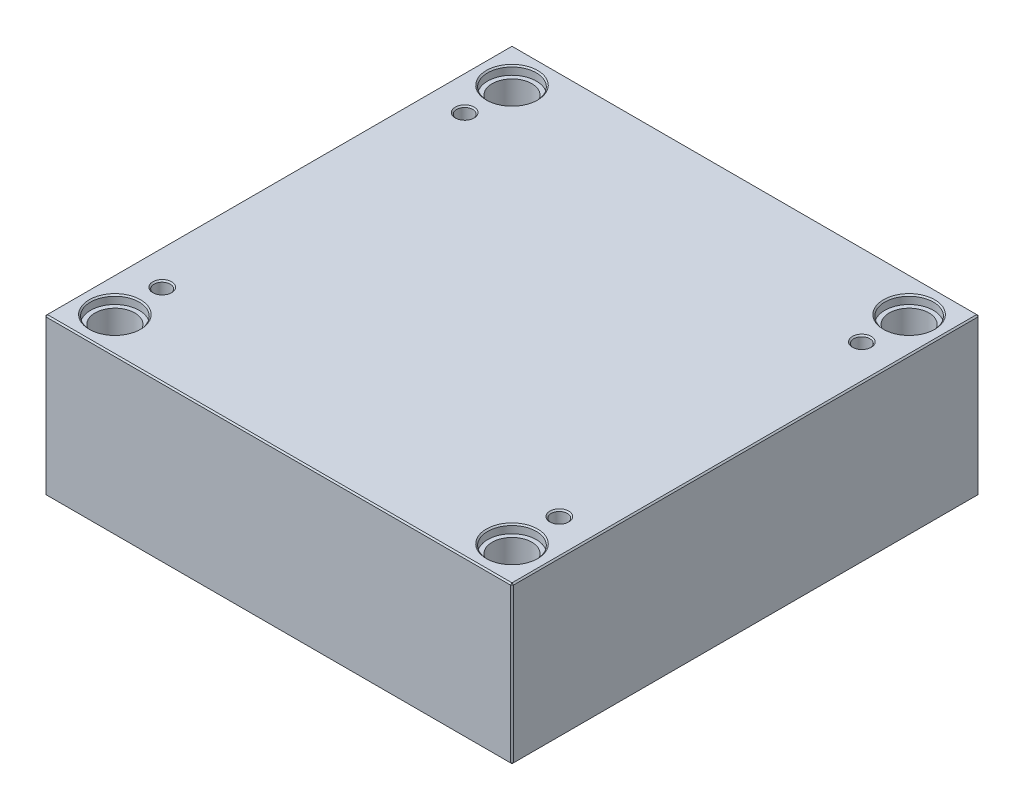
ISO-10303-21;
HEADER;
FILE_DESCRIPTION(('STEP AP214'),'2;1');
FILE_NAME('part.step','',(''),(''),'','','');
FILE_SCHEMA(('AUTOMOTIVE_DESIGN { 1 0 10303 214 1 1 1 1 }'));
ENDSEC;
DATA;
#1=APPLICATION_CONTEXT('core data for automotive mechanical design processes');
#2=APPLICATION_PROTOCOL_DEFINITION('international standard','automotive_design',2000,#1);
#3=PRODUCT_CONTEXT('',#1,'mechanical');
#4=PRODUCT('Part','Part','',(#3));
#5=PRODUCT_RELATED_PRODUCT_CATEGORY('part','',(#4));
#6=PRODUCT_DEFINITION_FORMATION('','',#4);
#7=PRODUCT_DEFINITION_CONTEXT('part definition',#1,'design');
#8=PRODUCT_DEFINITION('design','',#6,#7);
#9=PRODUCT_DEFINITION_SHAPE('','',#8);
#10=(LENGTH_UNIT() NAMED_UNIT(*) SI_UNIT(.MILLI.,.METRE.));
#11=(NAMED_UNIT(*) PLANE_ANGLE_UNIT() SI_UNIT($,.RADIAN.));
#12=(NAMED_UNIT(*) SI_UNIT($,.STERADIAN.) SOLID_ANGLE_UNIT());
#13=UNCERTAINTY_MEASURE_WITH_UNIT(LENGTH_MEASURE(1.E-05),#10,'distance_accuracy_value','');
#14=(GEOMETRIC_REPRESENTATION_CONTEXT(3) GLOBAL_UNCERTAINTY_ASSIGNED_CONTEXT((#13)) GLOBAL_UNIT_ASSIGNED_CONTEXT((#10,
#11,#12)) REPRESENTATION_CONTEXT('',''));
#15=CARTESIAN_POINT('',(0.,0.,0.));
#16=DIRECTION('',(0.,0.,1.));
#17=DIRECTION('',(1.,0.,0.));
#18=AXIS2_PLACEMENT_3D('',#15,#16,#17);
#19=CARTESIAN_POINT('',(-147.,0.,-147.));
#20=DIRECTION('',(0.,1.,0.));
#21=DIRECTION('',(0.,0.,1.));
#22=AXIS2_PLACEMENT_3D('',#19,#20,#21);
#23=CYLINDRICAL_SURFACE('',#22,14.7);
#24=CARTESIAN_POINT('',(-147.,0.999999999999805,-147.));
#25=DIRECTION('',(0.,1.,0.));
#26=DIRECTION('',(0.,0.,1.));
#27=AXIS2_PLACEMENT_3D('',#24,#25,#26);
#28=CIRCLE('',#27,14.7);
#29=CARTESIAN_POINT('',(-147.,0.999999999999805,-132.3));
#30=VERTEX_POINT('',#29);
#31=EDGE_CURVE('E472',#30,#30,#28,.F.);
#32=ORIENTED_EDGE('',*,*,#31,.T.);
#33=EDGE_LOOP('',(#32));
#34=FACE_BOUND('',#33,.T.);
#35=CARTESIAN_POINT('',(-147.,109.7,-147.));
#36=DIRECTION('',(0.,1.,0.));
#37=DIRECTION('',(0.,0.,1.));
#38=AXIS2_PLACEMENT_3D('',#35,#36,#37);
#39=CIRCLE('',#38,14.7);
#40=CARTESIAN_POINT('',(-147.,109.7,-132.3));
#41=VERTEX_POINT('',#40);
#42=EDGE_CURVE('E221',#41,#41,#39,.F.);
#43=ORIENTED_EDGE('',*,*,#42,.F.);
#44=EDGE_LOOP('',(#43));
#45=FACE_BOUND('',#44,.T.);
#46=ADVANCED_FACE('F16',(#34,#45),#23,.F.);
#47=CARTESIAN_POINT('',(147.,0.,-147.));
#48=DIRECTION('',(0.,1.,0.));
#49=DIRECTION('',(0.,0.,1.));
#50=AXIS2_PLACEMENT_3D('',#47,#48,#49);
#51=CYLINDRICAL_SURFACE('',#50,14.7);
#52=CARTESIAN_POINT('',(147.,0.999999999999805,-147.));
#53=DIRECTION('',(0.,1.,0.));
#54=DIRECTION('',(0.,0.,1.));
#55=AXIS2_PLACEMENT_3D('',#52,#53,#54);
#56=CIRCLE('',#55,14.7);
#57=CARTESIAN_POINT('',(147.,0.999999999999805,-132.3));
#58=VERTEX_POINT('',#57);
#59=EDGE_CURVE('E474',#58,#58,#56,.F.);
#60=ORIENTED_EDGE('',*,*,#59,.T.);
#61=EDGE_LOOP('',(#60));
#62=FACE_BOUND('',#61,.T.);
#63=CARTESIAN_POINT('',(147.,109.7,-147.));
#64=DIRECTION('',(0.,1.,0.));
#65=DIRECTION('',(0.,0.,1.));
#66=AXIS2_PLACEMENT_3D('',#63,#64,#65);
#67=CIRCLE('',#66,14.7);
#68=CARTESIAN_POINT('',(147.,109.7,-132.3));
#69=VERTEX_POINT('',#68);
#70=EDGE_CURVE('E218',#69,#69,#67,.F.);
#71=ORIENTED_EDGE('',*,*,#70,.F.);
#72=EDGE_LOOP('',(#71));
#73=FACE_BOUND('',#72,.T.);
#74=ADVANCED_FACE('F263',(#62,#73),#51,.F.);
#75=CARTESIAN_POINT('',(147.,0.,147.));
#76=DIRECTION('',(0.,1.,0.));
#77=DIRECTION('',(0.,0.,1.));
#78=AXIS2_PLACEMENT_3D('',#75,#76,#77);
#79=CYLINDRICAL_SURFACE('',#78,14.7);
#80=CARTESIAN_POINT('',(147.,0.999999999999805,147.));
#81=DIRECTION('',(0.,1.,0.));
#82=DIRECTION('',(0.,0.,1.));
#83=AXIS2_PLACEMENT_3D('',#80,#81,#82);
#84=CIRCLE('',#83,14.7);
#85=CARTESIAN_POINT('',(147.,0.999999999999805,161.7));
#86=VERTEX_POINT('',#85);
#87=EDGE_CURVE('E477',#86,#86,#84,.F.);
#88=ORIENTED_EDGE('',*,*,#87,.T.);
#89=EDGE_LOOP('',(#88));
#90=FACE_BOUND('',#89,.T.);
#91=CARTESIAN_POINT('',(147.,109.7,147.));
#92=DIRECTION('',(0.,1.,0.));
#93=DIRECTION('',(0.,0.,1.));
#94=AXIS2_PLACEMENT_3D('',#91,#92,#93);
#95=CIRCLE('',#94,14.7);
#96=CARTESIAN_POINT('',(147.,109.7,161.7));
#97=VERTEX_POINT('',#96);
#98=EDGE_CURVE('E214',#97,#97,#95,.F.);
#99=ORIENTED_EDGE('',*,*,#98,.F.);
#100=EDGE_LOOP('',(#99));
#101=FACE_BOUND('',#100,.T.);
#102=ADVANCED_FACE('F270',(#90,#101),#79,.F.);
#103=CARTESIAN_POINT('',(-147.,0.,147.));
#104=DIRECTION('',(0.,1.,0.));
#105=DIRECTION('',(0.,0.,1.));
#106=AXIS2_PLACEMENT_3D('',#103,#104,#105);
#107=CYLINDRICAL_SURFACE('',#106,14.7);
#108=CARTESIAN_POINT('',(-147.,0.999999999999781,147.));
#109=DIRECTION('',(0.,1.,0.));
#110=DIRECTION('',(0.,0.,1.));
#111=AXIS2_PLACEMENT_3D('',#108,#109,#110);
#112=CIRCLE('',#111,14.7);
#113=CARTESIAN_POINT('',(-147.,0.999999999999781,161.7));
#114=VERTEX_POINT('',#113);
#115=EDGE_CURVE('E480',#114,#114,#112,.F.);
#116=ORIENTED_EDGE('',*,*,#115,.T.);
#117=EDGE_LOOP('',(#116));
#118=FACE_BOUND('',#117,.T.);
#119=CARTESIAN_POINT('',(-147.,109.7,147.));
#120=DIRECTION('',(0.,1.,0.));
#121=DIRECTION('',(0.,0.,1.));
#122=AXIS2_PLACEMENT_3D('',#119,#120,#121);
#123=CIRCLE('',#122,14.7);
#124=CARTESIAN_POINT('',(-147.,109.7,161.7));
#125=VERTEX_POINT('',#124);
#126=EDGE_CURVE('E211',#125,#125,#123,.F.);
#127=ORIENTED_EDGE('',*,*,#126,.F.);
#128=EDGE_LOOP('',(#127));
#129=FACE_BOUND('',#128,.T.);
#130=ADVANCED_FACE('F277',(#118,#129),#107,.F.);
#131=CARTESIAN_POINT('',(-173.,116.,173.));
#132=DIRECTION('',(1.,0.,0.));
#133=DIRECTION('',(0.,0.,-1.));
#134=AXIS2_PLACEMENT_3D('',#131,#132,#133);
#135=PLANE('',#134);
#136=DIRECTION('',(0.,-1.,0.));
#137=VECTOR('',#136,1.);
#138=CARTESIAN_POINT('',(-173.,116.,-172.));
#139=LINE('',#138,#137);
#140=CARTESIAN_POINT('',(-173.,115.,-172.));
#141=VERTEX_POINT('',#140);
#142=CARTESIAN_POINT('',(-173.,1.00000000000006,-172.));
#143=VERTEX_POINT('',#142);
#144=EDGE_CURVE('E487',#141,#143,#139,.T.);
#145=ORIENTED_EDGE('',*,*,#144,.T.);
#146=DIRECTION('',(0.,0.,1.));
#147=VECTOR('',#146,1.);
#148=CARTESIAN_POINT('',(-173.,1.00000000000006,173.));
#149=LINE('',#148,#147);
#150=CARTESIAN_POINT('',(-173.,1.00000000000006,172.));
#151=VERTEX_POINT('',#150);
#152=EDGE_CURVE('E490',#143,#151,#149,.T.);
#153=ORIENTED_EDGE('',*,*,#152,.T.);
#154=DIRECTION('',(0.,1.,0.));
#155=VECTOR('',#154,1.);
#156=CARTESIAN_POINT('',(-173.,116.,172.));
#157=LINE('',#156,#155);
#158=CARTESIAN_POINT('',(-173.,115.,172.));
#159=VERTEX_POINT('',#158);
#160=EDGE_CURVE('E485',#151,#159,#157,.T.);
#161=ORIENTED_EDGE('',*,*,#160,.T.);
#162=DIRECTION('',(0.,0.,-1.));
#163=VECTOR('',#162,1.);
#164=CARTESIAN_POINT('',(-173.,115.,-173.));
#165=LINE('',#164,#163);
#166=EDGE_CURVE('E483',#159,#141,#165,.T.);
#167=ORIENTED_EDGE('',*,*,#166,.T.);
#168=EDGE_LOOP('',(#145,#153,#161,#167));
#169=FACE_BOUND('',#168,.T.);
#170=ADVANCED_FACE('F298',(#169),#135,.F.);
#171=CARTESIAN_POINT('',(173.,116.,173.));
#172=DIRECTION('',(0.,0.,-1.));
#173=DIRECTION('',(-1.,0.,0.));
#174=AXIS2_PLACEMENT_3D('',#171,#172,#173);
#175=PLANE('',#174);
#176=DIRECTION('',(-1.,0.,0.));
#177=VECTOR('',#176,1.);
#178=CARTESIAN_POINT('',(-173.,115.,173.));
#179=LINE('',#178,#177);
#180=CARTESIAN_POINT('',(172.,115.,173.));
#181=VERTEX_POINT('',#180);
#182=CARTESIAN_POINT('',(-172.,115.,173.));
#183=VERTEX_POINT('',#182);
#184=EDGE_CURVE('E509',#181,#183,#179,.T.);
#185=ORIENTED_EDGE('',*,*,#184,.T.);
#186=DIRECTION('',(0.,-1.,0.));
#187=VECTOR('',#186,1.);
#188=CARTESIAN_POINT('',(-172.,116.,173.));
#189=LINE('',#188,#187);
#190=CARTESIAN_POINT('',(-172.,1.00000000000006,173.));
#191=VERTEX_POINT('',#190);
#192=EDGE_CURVE('E515',#183,#191,#189,.T.);
#193=ORIENTED_EDGE('',*,*,#192,.T.);
#194=DIRECTION('',(1.,0.,0.));
#195=VECTOR('',#194,1.);
#196=CARTESIAN_POINT('',(173.,1.00000000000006,173.));
#197=LINE('',#196,#195);
#198=CARTESIAN_POINT('',(172.,1.00000000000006,173.));
#199=VERTEX_POINT('',#198);
#200=EDGE_CURVE('E513',#191,#199,#197,.T.);
#201=ORIENTED_EDGE('',*,*,#200,.T.);
#202=DIRECTION('',(0.,1.,0.));
#203=VECTOR('',#202,1.);
#204=CARTESIAN_POINT('',(172.,116.,173.));
#205=LINE('',#204,#203);
#206=EDGE_CURVE('E511',#199,#181,#205,.T.);
#207=ORIENTED_EDGE('',*,*,#206,.T.);
#208=EDGE_LOOP('',(#185,#193,#201,#207));
#209=FACE_BOUND('',#208,.T.);
#210=ADVANCED_FACE('F294',(#209),#175,.F.);
#211=CARTESIAN_POINT('',(173.,116.,173.));
#212=DIRECTION('',(-1.,0.,0.));
#213=DIRECTION('',(0.,0.,1.));
#214=AXIS2_PLACEMENT_3D('',#211,#212,#213);
#215=PLANE('',#214);
#216=DIRECTION('',(0.,0.,-1.));
#217=VECTOR('',#216,1.);
#218=CARTESIAN_POINT('',(173.,1.00000000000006,173.));
#219=LINE('',#218,#217);
#220=CARTESIAN_POINT('',(173.,1.00000000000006,172.));
#221=VERTEX_POINT('',#220);
#222=CARTESIAN_POINT('',(173.,1.00000000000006,-172.));
#223=VERTEX_POINT('',#222);
#224=EDGE_CURVE('E504',#221,#223,#219,.T.);
#225=ORIENTED_EDGE('',*,*,#224,.T.);
#226=DIRECTION('',(0.,1.,0.));
#227=VECTOR('',#226,1.);
#228=CARTESIAN_POINT('',(173.,116.,-172.));
#229=LINE('',#228,#227);
#230=CARTESIAN_POINT('',(173.,115.,-172.));
#231=VERTEX_POINT('',#230);
#232=EDGE_CURVE('E506',#223,#231,#229,.T.);
#233=ORIENTED_EDGE('',*,*,#232,.T.);
#234=DIRECTION('',(0.,0.,1.));
#235=VECTOR('',#234,1.);
#236=CARTESIAN_POINT('',(173.,115.,173.));
#237=LINE('',#236,#235);
#238=CARTESIAN_POINT('',(173.,115.,172.));
#239=VERTEX_POINT('',#238);
#240=EDGE_CURVE('E500',#231,#239,#237,.T.);
#241=ORIENTED_EDGE('',*,*,#240,.T.);
#242=DIRECTION('',(0.,-1.,0.));
#243=VECTOR('',#242,1.);
#244=CARTESIAN_POINT('',(173.,116.,172.));
#245=LINE('',#244,#243);
#246=EDGE_CURVE('E502',#239,#221,#245,.T.);
#247=ORIENTED_EDGE('',*,*,#246,.T.);
#248=EDGE_LOOP('',(#225,#233,#241,#247));
#249=FACE_BOUND('',#248,.T.);
#250=ADVANCED_FACE('F290',(#249),#215,.F.);
#251=CARTESIAN_POINT('',(173.,116.,-173.));
#252=DIRECTION('',(0.,0.,1.));
#253=DIRECTION('',(1.,0.,0.));
#254=AXIS2_PLACEMENT_3D('',#251,#252,#253);
#255=PLANE('',#254);
#256=DIRECTION('',(0.,-1.,0.));
#257=VECTOR('',#256,1.);
#258=CARTESIAN_POINT('',(172.,116.,-173.));
#259=LINE('',#258,#257);
#260=CARTESIAN_POINT('',(172.,115.,-173.));
#261=VERTEX_POINT('',#260);
#262=CARTESIAN_POINT('',(172.,1.00000000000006,-173.));
#263=VERTEX_POINT('',#262);
#264=EDGE_CURVE('E494',#261,#263,#259,.T.);
#265=ORIENTED_EDGE('',*,*,#264,.T.);
#266=DIRECTION('',(-1.,0.,0.));
#267=VECTOR('',#266,1.);
#268=CARTESIAN_POINT('',(173.,1.00000000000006,-173.));
#269=LINE('',#268,#267);
#270=CARTESIAN_POINT('',(-172.,1.00000000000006,-173.));
#271=VERTEX_POINT('',#270);
#272=EDGE_CURVE('E138',#263,#271,#269,.T.);
#273=ORIENTED_EDGE('',*,*,#272,.T.);
#274=DIRECTION('',(0.,1.,0.));
#275=VECTOR('',#274,1.);
#276=CARTESIAN_POINT('',(-172.,116.,-173.));
#277=LINE('',#276,#275);
#278=CARTESIAN_POINT('',(-172.,115.,-173.));
#279=VERTEX_POINT('',#278);
#280=EDGE_CURVE('E496',#271,#279,#277,.T.);
#281=ORIENTED_EDGE('',*,*,#280,.T.);
#282=DIRECTION('',(1.,0.,0.));
#283=VECTOR('',#282,1.);
#284=CARTESIAN_POINT('',(173.,115.,-173.));
#285=LINE('',#284,#283);
#286=EDGE_CURVE('E492',#279,#261,#285,.T.);
#287=ORIENTED_EDGE('',*,*,#286,.T.);
#288=EDGE_LOOP('',(#265,#273,#281,#287));
#289=FACE_BOUND('',#288,.T.);
#290=ADVANCED_FACE('F282',(#289),#255,.F.);
#291=CARTESIAN_POINT('',(0.,116.,0.));
#292=DIRECTION('',(0.,1.,0.));
#293=DIRECTION('',(0.,0.,1.));
#294=AXIS2_PLACEMENT_3D('',#291,#292,#293);
#295=PLANE('',#294);
#296=CARTESIAN_POINT('',(147.,116.,147.));
#297=DIRECTION('',(0.,1.,0.));
#298=DIRECTION('',(0.,0.,1.));
#299=AXIS2_PLACEMENT_3D('',#296,#297,#298);
#300=CIRCLE('',#299,19.);
#301=CARTESIAN_POINT('',(147.,116.,166.));
#302=VERTEX_POINT('',#301);
#303=EDGE_CURVE('E236',#302,#302,#300,.F.);
#304=ORIENTED_EDGE('',*,*,#303,.T.);
#305=EDGE_LOOP('',(#304));
#306=FACE_BOUND('',#305,.T.);
#307=CARTESIAN_POINT('',(-147.,116.,147.));
#308=DIRECTION('',(0.,1.,0.));
#309=DIRECTION('',(0.,0.,1.));
#310=AXIS2_PLACEMENT_3D('',#307,#308,#309);
#311=CIRCLE('',#310,19.);
#312=CARTESIAN_POINT('',(-147.,116.,166.));
#313=VERTEX_POINT('',#312);
#314=EDGE_CURVE('E233',#313,#313,#311,.F.);
#315=ORIENTED_EDGE('',*,*,#314,.T.);
#316=EDGE_LOOP('',(#315));
#317=FACE_BOUND('',#316,.T.);
#318=CARTESIAN_POINT('',(147.,116.,-147.));
#319=DIRECTION('',(0.,1.,0.));
#320=DIRECTION('',(0.,0.,1.));
#321=AXIS2_PLACEMENT_3D('',#318,#319,#320);
#322=CIRCLE('',#321,19.);
#323=CARTESIAN_POINT('',(147.,116.,-128.));
#324=VERTEX_POINT('',#323);
#325=EDGE_CURVE('E230',#324,#324,#322,.F.);
#326=ORIENTED_EDGE('',*,*,#325,.T.);
#327=EDGE_LOOP('',(#326));
#328=FACE_BOUND('',#327,.T.);
#329=CARTESIAN_POINT('',(-147.,116.,-147.));
#330=DIRECTION('',(0.,1.,0.));
#331=DIRECTION('',(0.,0.,1.));
#332=AXIS2_PLACEMENT_3D('',#329,#330,#331);
#333=CIRCLE('',#332,19.);
#334=CARTESIAN_POINT('',(-147.,116.,-128.));
#335=VERTEX_POINT('',#334);
#336=EDGE_CURVE('E227',#335,#335,#333,.F.);
#337=ORIENTED_EDGE('',*,*,#336,.T.);
#338=EDGE_LOOP('',(#337));
#339=FACE_BOUND('',#338,.T.);
#340=CARTESIAN_POINT('',(-147.,116.,112.));
#341=DIRECTION('',(0.,1.,0.));
#342=DIRECTION('',(0.,0.,1.));
#343=AXIS2_PLACEMENT_3D('',#340,#341,#342);
#344=CIRCLE('',#343,6.9999999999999);
#345=CARTESIAN_POINT('',(-147.,116.,119.));
#346=VERTEX_POINT('',#345);
#347=EDGE_CURVE('E198',#346,#346,#344,.F.);
#348=ORIENTED_EDGE('',*,*,#347,.T.);
#349=EDGE_LOOP('',(#348));
#350=FACE_BOUND('',#349,.T.);
#351=CARTESIAN_POINT('',(147.,116.,112.));
#352=DIRECTION('',(0.,1.,0.));
#353=DIRECTION('',(0.,0.,1.));
#354=AXIS2_PLACEMENT_3D('',#351,#352,#353);
#355=CIRCLE('',#354,6.9999999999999);
#356=CARTESIAN_POINT('',(147.,116.,119.));
#357=VERTEX_POINT('',#356);
#358=EDGE_CURVE('E195',#357,#357,#355,.F.);
#359=ORIENTED_EDGE('',*,*,#358,.T.);
#360=EDGE_LOOP('',(#359));
#361=FACE_BOUND('',#360,.T.);
#362=CARTESIAN_POINT('',(147.,116.,-112.));
#363=DIRECTION('',(0.,1.,0.));
#364=DIRECTION('',(0.,0.,1.));
#365=AXIS2_PLACEMENT_3D('',#362,#363,#364);
#366=CIRCLE('',#365,6.9999999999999);
#367=CARTESIAN_POINT('',(147.,116.,-105.));
#368=VERTEX_POINT('',#367);
#369=EDGE_CURVE('E192',#368,#368,#366,.F.);
#370=ORIENTED_EDGE('',*,*,#369,.T.);
#371=EDGE_LOOP('',(#370));
#372=FACE_BOUND('',#371,.T.);
#373=CARTESIAN_POINT('',(-147.,116.,-112.));
#374=DIRECTION('',(0.,1.,0.));
#375=DIRECTION('',(0.,0.,1.));
#376=AXIS2_PLACEMENT_3D('',#373,#374,#375);
#377=CIRCLE('',#376,6.9999999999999);
#378=CARTESIAN_POINT('',(-147.,116.,-105.));
#379=VERTEX_POINT('',#378);
#380=EDGE_CURVE('E188',#379,#379,#377,.F.);
#381=ORIENTED_EDGE('',*,*,#380,.T.);
#382=EDGE_LOOP('',(#381));
#383=FACE_BOUND('',#382,.T.);
#384=DIRECTION('',(0.,0.,-1.));
#385=VECTOR('',#384,1.);
#386=CARTESIAN_POINT('',(172.,116.,-173.));
#387=LINE('',#386,#385);
#388=CARTESIAN_POINT('',(172.,116.,172.));
#389=VERTEX_POINT('',#388);
#390=CARTESIAN_POINT('',(172.,116.,-172.));
#391=VERTEX_POINT('',#390);
#392=EDGE_CURVE('E31',#389,#391,#387,.T.);
#393=ORIENTED_EDGE('',*,*,#392,.T.);
#394=DIRECTION('',(-1.,0.,0.));
#395=VECTOR('',#394,1.);
#396=CARTESIAN_POINT('',(-173.,116.,-172.));
#397=LINE('',#396,#395);
#398=CARTESIAN_POINT('',(-172.,116.,-172.));
#399=VERTEX_POINT('',#398);
#400=EDGE_CURVE('E189',#391,#399,#397,.T.);
#401=ORIENTED_EDGE('',*,*,#400,.T.);
#402=DIRECTION('',(0.,0.,1.));
#403=VECTOR('',#402,1.);
#404=CARTESIAN_POINT('',(-172.,116.,173.));
#405=LINE('',#404,#403);
#406=CARTESIAN_POINT('',(-172.,116.,172.));
#407=VERTEX_POINT('',#406);
#408=EDGE_CURVE('E518',#399,#407,#405,.T.);
#409=ORIENTED_EDGE('',*,*,#408,.T.);
#410=DIRECTION('',(1.,0.,0.));
#411=VECTOR('',#410,1.);
#412=CARTESIAN_POINT('',(173.,116.,172.));
#413=LINE('',#412,#411);
#414=EDGE_CURVE('E36',#407,#389,#413,.T.);
#415=ORIENTED_EDGE('',*,*,#414,.T.);
#416=EDGE_LOOP('',(#393,#401,#409,#415));
#417=FACE_BOUND('',#416,.T.);
#418=ADVANCED_FACE('F279',(#306,#317,#328,#339,#350,#361,#372,#383,#417),#295,.T.);
#419=CARTESIAN_POINT('',(0.,0.,0.));
#420=DIRECTION('',(0.,1.,0.));
#421=DIRECTION('',(0.,0.,1.));
#422=AXIS2_PLACEMENT_3D('',#419,#420,#421);
#423=PLANE('',#422);
#424=CARTESIAN_POINT('',(-147.,0.,-147.));
#425=DIRECTION('',(0.,1.,0.));
#426=DIRECTION('',(0.,0.,1.));
#427=AXIS2_PLACEMENT_3D('',#424,#425,#426);
#428=CIRCLE('',#427,15.6999999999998);
#429=CARTESIAN_POINT('',(-147.,0.,-131.3));
#430=VERTEX_POINT('',#429);
#431=EDGE_CURVE('E469',#430,#430,#428,.T.);
#432=ORIENTED_EDGE('',*,*,#431,.T.);
#433=EDGE_LOOP('',(#432));
#434=FACE_BOUND('',#433,.T.);
#435=CARTESIAN_POINT('',(147.,0.,-147.));
#436=DIRECTION('',(0.,1.,0.));
#437=DIRECTION('',(0.,0.,1.));
#438=AXIS2_PLACEMENT_3D('',#435,#436,#437);
#439=CIRCLE('',#438,15.6999999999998);
#440=CARTESIAN_POINT('',(147.,0.,-131.3));
#441=VERTEX_POINT('',#440);
#442=EDGE_CURVE('E466',#441,#441,#439,.T.);
#443=ORIENTED_EDGE('',*,*,#442,.T.);
#444=EDGE_LOOP('',(#443));
#445=FACE_BOUND('',#444,.T.);
#446=CARTESIAN_POINT('',(147.,0.,147.));
#447=DIRECTION('',(0.,1.,0.));
#448=DIRECTION('',(0.,0.,1.));
#449=AXIS2_PLACEMENT_3D('',#446,#447,#448);
#450=CIRCLE('',#449,15.6999999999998);
#451=CARTESIAN_POINT('',(147.,0.,162.7));
#452=VERTEX_POINT('',#451);
#453=EDGE_CURVE('E463',#452,#452,#450,.T.);
#454=ORIENTED_EDGE('',*,*,#453,.T.);
#455=EDGE_LOOP('',(#454));
#456=FACE_BOUND('',#455,.T.);
#457=CARTESIAN_POINT('',(-147.,0.,147.));
#458=DIRECTION('',(0.,1.,0.));
#459=DIRECTION('',(0.,0.,1.));
#460=AXIS2_PLACEMENT_3D('',#457,#458,#459);
#461=CIRCLE('',#460,15.6999999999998);
#462=CARTESIAN_POINT('',(-147.,0.,162.7));
#463=VERTEX_POINT('',#462);
#464=EDGE_CURVE('E460',#463,#463,#461,.T.);
#465=ORIENTED_EDGE('',*,*,#464,.T.);
#466=EDGE_LOOP('',(#465));
#467=FACE_BOUND('',#466,.T.);
#468=DIRECTION('',(0.,0.,1.));
#469=VECTOR('',#468,1.);
#470=CARTESIAN_POINT('',(172.,0.,0.));
#471=LINE('',#470,#469);
#472=CARTESIAN_POINT('',(172.,0.,-172.));
#473=VERTEX_POINT('',#472);
#474=CARTESIAN_POINT('',(172.,0.,172.));
#475=VERTEX_POINT('',#474);
#476=EDGE_CURVE('E108',#473,#475,#471,.T.);
#477=ORIENTED_EDGE('',*,*,#476,.T.);
#478=DIRECTION('',(-1.,0.,0.));
#479=VECTOR('',#478,1.);
#480=CARTESIAN_POINT('',(0.,0.,172.));
#481=LINE('',#480,#479);
#482=CARTESIAN_POINT('',(-172.,0.,172.));
#483=VERTEX_POINT('',#482);
#484=EDGE_CURVE('E458',#475,#483,#481,.T.);
#485=ORIENTED_EDGE('',*,*,#484,.T.);
#486=DIRECTION('',(0.,0.,-1.));
#487=VECTOR('',#486,1.);
#488=CARTESIAN_POINT('',(-172.,0.,0.));
#489=LINE('',#488,#487);
#490=CARTESIAN_POINT('',(-172.,0.,-172.));
#491=VERTEX_POINT('',#490);
#492=EDGE_CURVE('E110',#483,#491,#489,.T.);
#493=ORIENTED_EDGE('',*,*,#492,.T.);
#494=DIRECTION('',(1.,0.,0.));
#495=VECTOR('',#494,1.);
#496=CARTESIAN_POINT('',(0.,0.,-172.));
#497=LINE('',#496,#495);
#498=EDGE_CURVE('E104',#491,#473,#497,.T.);
#499=ORIENTED_EDGE('',*,*,#498,.T.);
#500=EDGE_LOOP('',(#477,#485,#493,#499));
#501=FACE_BOUND('',#500,.T.);
#502=ADVANCED_FACE('F106',(#434,#445,#456,#467,#501),#423,.F.);
#503=CARTESIAN_POINT('',(-147.,0.,-147.));
#504=DIRECTION('',(0.,-1.,0.));
#505=DIRECTION('',(0.,0.,-1.));
#506=AXIS2_PLACEMENT_3D('',#503,#504,#505);
#507=CONICAL_SURFACE('',#506,15.6999999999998,0.785398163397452);
#508=ORIENTED_EDGE('',*,*,#31,.F.);
#509=EDGE_LOOP('',(#508));
#510=FACE_BOUND('',#509,.T.);
#511=ORIENTED_EDGE('',*,*,#431,.F.);
#512=EDGE_LOOP('',(#511));
#513=FACE_BOUND('',#512,.T.);
#514=ADVANCED_FACE('F286',(#510,#513),#507,.F.);
#515=CARTESIAN_POINT('',(147.,0.,-147.));
#516=DIRECTION('',(0.,-1.,0.));
#517=DIRECTION('',(0.,0.,-1.));
#518=AXIS2_PLACEMENT_3D('',#515,#516,#517);
#519=CONICAL_SURFACE('',#518,15.6999999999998,0.785398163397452);
#520=ORIENTED_EDGE('',*,*,#59,.F.);
#521=EDGE_LOOP('',(#520));
#522=FACE_BOUND('',#521,.T.);
#523=ORIENTED_EDGE('',*,*,#442,.F.);
#524=EDGE_LOOP('',(#523));
#525=FACE_BOUND('',#524,.T.);
#526=ADVANCED_FACE('F305',(#522,#525),#519,.F.);
#527=CARTESIAN_POINT('',(147.,0.,147.));
#528=DIRECTION('',(0.,-1.,0.));
#529=DIRECTION('',(0.,0.,-1.));
#530=AXIS2_PLACEMENT_3D('',#527,#528,#529);
#531=CONICAL_SURFACE('',#530,15.6999999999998,0.785398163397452);
#532=ORIENTED_EDGE('',*,*,#87,.F.);
#533=EDGE_LOOP('',(#532));
#534=FACE_BOUND('',#533,.T.);
#535=ORIENTED_EDGE('',*,*,#453,.F.);
#536=EDGE_LOOP('',(#535));
#537=FACE_BOUND('',#536,.T.);
#538=ADVANCED_FACE('F309',(#534,#537),#531,.F.);
#539=CARTESIAN_POINT('',(-147.,0.,147.));
#540=DIRECTION('',(0.,-1.,0.));
#541=DIRECTION('',(0.,0.,-1.));
#542=AXIS2_PLACEMENT_3D('',#539,#540,#541);
#543=CONICAL_SURFACE('',#542,15.6999999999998,0.78539816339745);
#544=ORIENTED_EDGE('',*,*,#115,.F.);
#545=EDGE_LOOP('',(#544));
#546=FACE_BOUND('',#545,.T.);
#547=ORIENTED_EDGE('',*,*,#464,.F.);
#548=EDGE_LOOP('',(#547));
#549=FACE_BOUND('',#548,.T.);
#550=ADVANCED_FACE('F313',(#546,#549),#543,.F.);
#551=CARTESIAN_POINT('',(173.,116.,172.));
#552=DIRECTION('',(-0.707106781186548,0.,-0.707106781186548));
#553=DIRECTION('',(0.,-1.,0.));
#554=AXIS2_PLACEMENT_3D('',#551,#552,#553);
#555=PLANE('',#554);
#556=DIRECTION('',(-0.707106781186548,0.,0.707106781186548));
#557=VECTOR('',#556,1.);
#558=CARTESIAN_POINT('',(172.,115.,173.));
#559=LINE('',#558,#557);
#560=EDGE_CURVE('E126',#181,#239,#559,.F.);
#561=ORIENTED_EDGE('',*,*,#560,.F.);
#562=ORIENTED_EDGE('',*,*,#206,.F.);
#563=DIRECTION('',(0.707106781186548,0.,-0.707106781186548));
#564=VECTOR('',#563,1.);
#565=CARTESIAN_POINT('',(172.,1.00000000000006,173.));
#566=LINE('',#565,#564);
#567=EDGE_CURVE('E180',#221,#199,#566,.F.);
#568=ORIENTED_EDGE('',*,*,#567,.F.);
#569=ORIENTED_EDGE('',*,*,#246,.F.);
#570=EDGE_LOOP('',(#561,#562,#568,#569));
#571=FACE_BOUND('',#570,.T.);
#572=ADVANCED_FACE('F317',(#571),#555,.F.);
#573=CARTESIAN_POINT('',(172.,115.,173.));
#574=DIRECTION('',(0.577350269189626,0.577350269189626,0.577350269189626));
#575=DIRECTION('',(0.707106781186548,0.,-0.707106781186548));
#576=AXIS2_PLACEMENT_3D('',#573,#574,#575);
#577=PLANE('',#576);
#578=DIRECTION('',(0.,-0.707106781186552,0.707106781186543));
#579=VECTOR('',#578,1.);
#580=CARTESIAN_POINT('',(172.,115.,173.));
#581=LINE('',#580,#579);
#582=EDGE_CURVE('E175',#181,#389,#581,.F.);
#583=ORIENTED_EDGE('',*,*,#582,.F.);
#584=ORIENTED_EDGE('',*,*,#560,.T.);
#585=DIRECTION('',(-0.707106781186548,0.707106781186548,0.));
#586=VECTOR('',#585,1.);
#587=CARTESIAN_POINT('',(172.5,115.5,172.));
#588=LINE('',#587,#586);
#589=EDGE_CURVE('E177',#389,#239,#588,.F.);
#590=ORIENTED_EDGE('',*,*,#589,.F.);
#591=EDGE_LOOP('',(#583,#584,#590));
#592=FACE_BOUND('',#591,.T.);
#593=ADVANCED_FACE('F385',(#592),#577,.T.);
#594=CARTESIAN_POINT('',(172.,1.00000000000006,173.));
#595=DIRECTION('',(0.577350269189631,-0.577350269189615,0.577350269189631));
#596=DIRECTION('',(0.707106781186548,0.,-0.707106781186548));
#597=AXIS2_PLACEMENT_3D('',#594,#595,#596);
#598=PLANE('',#597);
#599=DIRECTION('',(-0.707106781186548,-0.707106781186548,0.));
#600=VECTOR('',#599,1.);
#601=CARTESIAN_POINT('',(172.5,0.500000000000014,172.));
#602=LINE('',#601,#600);
#603=EDGE_CURVE('E124',#221,#475,#602,.T.);
#604=ORIENTED_EDGE('',*,*,#603,.F.);
#605=ORIENTED_EDGE('',*,*,#567,.T.);
#606=DIRECTION('',(0.,0.707106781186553,0.707106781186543));
#607=VECTOR('',#606,1.);
#608=CARTESIAN_POINT('',(172.,1.00000000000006,173.));
#609=LINE('',#608,#607);
#610=EDGE_CURVE('E172',#475,#199,#609,.T.);
#611=ORIENTED_EDGE('',*,*,#610,.F.);
#612=EDGE_LOOP('',(#604,#605,#611));
#613=FACE_BOUND('',#612,.T.);
#614=ADVANCED_FACE('F381',(#613),#598,.T.);
#615=CARTESIAN_POINT('',(172.,116.,0.));
#616=DIRECTION('',(0.707106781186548,0.707106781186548,0.));
#617=DIRECTION('',(0.,0.,1.));
#618=AXIS2_PLACEMENT_3D('',#615,#616,#617);
#619=PLANE('',#618);
#620=ORIENTED_EDGE('',*,*,#589,.T.);
#621=ORIENTED_EDGE('',*,*,#240,.F.);
#622=DIRECTION('',(0.707106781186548,-0.707106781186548,0.));
#623=VECTOR('',#622,1.);
#624=CARTESIAN_POINT('',(173.,115.,-172.));
#625=LINE('',#624,#623);
#626=EDGE_CURVE('E166',#391,#231,#625,.T.);
#627=ORIENTED_EDGE('',*,*,#626,.F.);
#628=ORIENTED_EDGE('',*,*,#392,.F.);
#629=EDGE_LOOP('',(#620,#621,#627,#628));
#630=FACE_BOUND('',#629,.T.);
#631=ADVANCED_FACE('F377',(#630),#619,.T.);
#632=CARTESIAN_POINT('',(0.,116.,172.));
#633=DIRECTION('',(0.,0.707106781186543,0.707106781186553));
#634=DIRECTION('',(-1.,0.,0.));
#635=AXIS2_PLACEMENT_3D('',#632,#633,#634);
#636=PLANE('',#635);
#637=ORIENTED_EDGE('',*,*,#582,.T.);
#638=ORIENTED_EDGE('',*,*,#414,.F.);
#639=DIRECTION('',(0.,0.707106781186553,-0.707106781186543));
#640=VECTOR('',#639,1.);
#641=CARTESIAN_POINT('',(-172.,115.5,172.5));
#642=LINE('',#641,#640);
#643=EDGE_CURVE('E163',#183,#407,#642,.T.);
#644=ORIENTED_EDGE('',*,*,#643,.F.);
#645=ORIENTED_EDGE('',*,*,#184,.F.);
#646=EDGE_LOOP('',(#637,#638,#644,#645));
#647=FACE_BOUND('',#646,.T.);
#648=ADVANCED_FACE('F373',(#647),#636,.T.);
#649=CARTESIAN_POINT('',(-172.,116.,173.));
#650=DIRECTION('',(0.707106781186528,0.,-0.707106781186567));
#651=DIRECTION('',(0.,-1.,0.));
#652=AXIS2_PLACEMENT_3D('',#649,#650,#651);
#653=PLANE('',#652);
#654=DIRECTION('',(0.707106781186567,0.,0.707106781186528));
#655=VECTOR('',#654,1.);
#656=CARTESIAN_POINT('',(-172.,1.00000000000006,173.));
#657=LINE('',#656,#655);
#658=EDGE_CURVE('E157',#191,#151,#657,.F.);
#659=ORIENTED_EDGE('',*,*,#658,.F.);
#660=ORIENTED_EDGE('',*,*,#192,.F.);
#661=DIRECTION('',(-0.707106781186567,0.,-0.707106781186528));
#662=VECTOR('',#661,1.);
#663=CARTESIAN_POINT('',(-173.,115.,172.));
#664=LINE('',#663,#662);
#665=EDGE_CURVE('E160',#159,#183,#664,.F.);
#666=ORIENTED_EDGE('',*,*,#665,.F.);
#667=ORIENTED_EDGE('',*,*,#160,.F.);
#668=EDGE_LOOP('',(#659,#660,#666,#667));
#669=FACE_BOUND('',#668,.T.);
#670=ADVANCED_FACE('F369',(#669),#653,.F.);
#671=CARTESIAN_POINT('',(173.,1.00000000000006,173.));
#672=DIRECTION('',(0.,0.707106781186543,-0.707106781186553));
#673=DIRECTION('',(1.,0.,0.));
#674=AXIS2_PLACEMENT_3D('',#671,#672,#673);
#675=PLANE('',#674);
#676=ORIENTED_EDGE('',*,*,#610,.T.);
#677=ORIENTED_EDGE('',*,*,#200,.F.);
#678=DIRECTION('',(0.,-0.707106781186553,-0.707106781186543));
#679=VECTOR('',#678,1.);
#680=CARTESIAN_POINT('',(-172.,1.00000000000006,173.));
#681=LINE('',#680,#679);
#682=EDGE_CURVE('E135',#483,#191,#681,.F.);
#683=ORIENTED_EDGE('',*,*,#682,.F.);
#684=ORIENTED_EDGE('',*,*,#484,.F.);
#685=EDGE_LOOP('',(#676,#677,#683,#684));
#686=FACE_BOUND('',#685,.T.);
#687=ADVANCED_FACE('F366',(#686),#675,.F.);
#688=CARTESIAN_POINT('',(173.,1.00000000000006,173.));
#689=DIRECTION('',(-0.707106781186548,0.707106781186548,0.));
#690=DIRECTION('',(0.,0.,-1.));
#691=AXIS2_PLACEMENT_3D('',#688,#689,#690);
#692=PLANE('',#691);
#693=ORIENTED_EDGE('',*,*,#603,.T.);
#694=ORIENTED_EDGE('',*,*,#476,.F.);
#695=DIRECTION('',(0.707106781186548,0.707106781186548,0.));
#696=VECTOR('',#695,1.);
#697=CARTESIAN_POINT('',(172.5,0.499999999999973,-172.));
#698=LINE('',#697,#696);
#699=EDGE_CURVE('E121',#223,#473,#698,.F.);
#700=ORIENTED_EDGE('',*,*,#699,.F.);
#701=ORIENTED_EDGE('',*,*,#224,.F.);
#702=EDGE_LOOP('',(#693,#694,#700,#701));
#703=FACE_BOUND('',#702,.T.);
#704=ADVANCED_FACE('F119',(#703),#692,.F.);
#705=CARTESIAN_POINT('',(172.,116.,-173.));
#706=DIRECTION('',(-0.707106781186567,0.,0.707106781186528));
#707=DIRECTION('',(0.,-1.,0.));
#708=AXIS2_PLACEMENT_3D('',#705,#706,#707);
#709=PLANE('',#708);
#710=DIRECTION('',(0.707106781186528,0.,0.707106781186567));
#711=VECTOR('',#710,1.);
#712=CARTESIAN_POINT('',(173.,115.,-172.));
#713=LINE('',#712,#711);
#714=EDGE_CURVE('E168',#231,#261,#713,.F.);
#715=ORIENTED_EDGE('',*,*,#714,.F.);
#716=ORIENTED_EDGE('',*,*,#232,.F.);
#717=DIRECTION('',(-0.707106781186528,0.,-0.707106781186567));
#718=VECTOR('',#717,1.);
#719=CARTESIAN_POINT('',(172.,1.00000000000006,-173.));
#720=LINE('',#719,#718);
#721=EDGE_CURVE('E134',#263,#223,#720,.F.);
#722=ORIENTED_EDGE('',*,*,#721,.F.);
#723=ORIENTED_EDGE('',*,*,#264,.F.);
#724=EDGE_LOOP('',(#715,#716,#722,#723));
#725=FACE_BOUND('',#724,.T.);
#726=ADVANCED_FACE('F359',(#725),#709,.F.);
#727=CARTESIAN_POINT('',(173.,115.,-172.));
#728=DIRECTION('',(0.577350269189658,0.577350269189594,-0.577350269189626));
#729=DIRECTION('',(-0.707106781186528,0.,-0.707106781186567));
#730=AXIS2_PLACEMENT_3D('',#727,#728,#729);
#731=PLANE('',#730);
#732=ORIENTED_EDGE('',*,*,#626,.T.);
#733=ORIENTED_EDGE('',*,*,#714,.T.);
#734=DIRECTION('',(0.,0.707106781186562,0.707106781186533));
#735=VECTOR('',#734,1.);
#736=CARTESIAN_POINT('',(172.,115.5,-172.5));
#737=LINE('',#736,#735);
#738=EDGE_CURVE('E152',#391,#261,#737,.F.);
#739=ORIENTED_EDGE('',*,*,#738,.F.);
#740=EDGE_LOOP('',(#732,#733,#739));
#741=FACE_BOUND('',#740,.T.);
#742=ADVANCED_FACE('F355',(#741),#731,.T.);
#743=CARTESIAN_POINT('',(-173.,115.,172.));
#744=DIRECTION('',(-0.577350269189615,0.577350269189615,0.577350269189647));
#745=DIRECTION('',(0.707106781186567,0.,0.707106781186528));
#746=AXIS2_PLACEMENT_3D('',#743,#744,#745);
#747=PLANE('',#746);
#748=ORIENTED_EDGE('',*,*,#665,.T.);
#749=ORIENTED_EDGE('',*,*,#643,.T.);
#750=DIRECTION('',(-0.707106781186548,-0.707106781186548,0.));
#751=VECTOR('',#750,1.);
#752=CARTESIAN_POINT('',(-173.,115.,172.));
#753=LINE('',#752,#751);
#754=EDGE_CURVE('E143',#159,#407,#753,.F.);
#755=ORIENTED_EDGE('',*,*,#754,.F.);
#756=EDGE_LOOP('',(#748,#749,#755));
#757=FACE_BOUND('',#756,.T.);
#758=ADVANCED_FACE('F351',(#757),#747,.T.);
#759=CARTESIAN_POINT('',(-172.,1.00000000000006,173.));
#760=DIRECTION('',(-0.57735026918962,-0.577350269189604,0.577350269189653));
#761=DIRECTION('',(0.707106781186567,0.,0.707106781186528));
#762=AXIS2_PLACEMENT_3D('',#759,#760,#761);
#763=PLANE('',#762);
#764=ORIENTED_EDGE('',*,*,#682,.T.);
#765=ORIENTED_EDGE('',*,*,#658,.T.);
#766=DIRECTION('',(-0.707106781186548,0.707106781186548,0.));
#767=VECTOR('',#766,1.);
#768=CARTESIAN_POINT('',(-172.5,0.499999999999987,172.));
#769=LINE('',#768,#767);
#770=EDGE_CURVE('E139',#483,#151,#769,.T.);
#771=ORIENTED_EDGE('',*,*,#770,.F.);
#772=EDGE_LOOP('',(#764,#765,#771));
#773=FACE_BOUND('',#772,.T.);
#774=ADVANCED_FACE('F348',(#773),#763,.T.);
#775=CARTESIAN_POINT('',(172.,1.00000000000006,-173.));
#776=DIRECTION('',(0.577350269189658,-0.577350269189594,-0.577350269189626));
#777=DIRECTION('',(-0.707106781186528,0.,-0.707106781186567));
#778=AXIS2_PLACEMENT_3D('',#775,#776,#777);
#779=PLANE('',#778);
#780=ORIENTED_EDGE('',*,*,#721,.T.);
#781=ORIENTED_EDGE('',*,*,#699,.T.);
#782=DIRECTION('',(0.,-0.707106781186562,0.707106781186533));
#783=VECTOR('',#782,1.);
#784=CARTESIAN_POINT('',(172.,1.00000000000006,-173.));
#785=LINE('',#784,#783);
#786=EDGE_CURVE('E131',#263,#473,#785,.T.);
#787=ORIENTED_EDGE('',*,*,#786,.F.);
#788=EDGE_LOOP('',(#780,#781,#787));
#789=FACE_BOUND('',#788,.T.);
#790=ADVANCED_FACE('F130',(#789),#779,.T.);
#791=CARTESIAN_POINT('',(0.,116.,-172.));
#792=DIRECTION('',(0.,0.707106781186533,-0.707106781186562));
#793=DIRECTION('',(1.,0.,0.));
#794=AXIS2_PLACEMENT_3D('',#791,#792,#793);
#795=PLANE('',#794);
#796=ORIENTED_EDGE('',*,*,#738,.T.);
#797=ORIENTED_EDGE('',*,*,#286,.F.);
#798=DIRECTION('',(0.,-0.707106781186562,-0.707106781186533));
#799=VECTOR('',#798,1.);
#800=CARTESIAN_POINT('',(-172.,115.,-173.));
#801=LINE('',#800,#799);
#802=EDGE_CURVE('E140',#399,#279,#801,.T.);
#803=ORIENTED_EDGE('',*,*,#802,.F.);
#804=ORIENTED_EDGE('',*,*,#400,.F.);
#805=EDGE_LOOP('',(#796,#797,#803,#804));
#806=FACE_BOUND('',#805,.T.);
#807=ADVANCED_FACE('F341',(#806),#795,.T.);
#808=CARTESIAN_POINT('',(-172.,116.,0.));
#809=DIRECTION('',(-0.707106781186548,0.707106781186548,0.));
#810=DIRECTION('',(0.,0.,-1.));
#811=AXIS2_PLACEMENT_3D('',#808,#809,#810);
#812=PLANE('',#811);
#813=ORIENTED_EDGE('',*,*,#754,.T.);
#814=ORIENTED_EDGE('',*,*,#408,.F.);
#815=DIRECTION('',(0.707106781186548,0.707106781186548,0.));
#816=VECTOR('',#815,1.);
#817=CARTESIAN_POINT('',(-172.5,115.5,-172.));
#818=LINE('',#817,#816);
#819=EDGE_CURVE('E146',#141,#399,#818,.T.);
#820=ORIENTED_EDGE('',*,*,#819,.F.);
#821=ORIENTED_EDGE('',*,*,#166,.F.);
#822=EDGE_LOOP('',(#813,#814,#820,#821));
#823=FACE_BOUND('',#822,.T.);
#824=ADVANCED_FACE('F337',(#823),#812,.T.);
#825=CARTESIAN_POINT('',(-173.,1.00000000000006,173.));
#826=DIRECTION('',(0.707106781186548,0.707106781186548,0.));
#827=DIRECTION('',(0.,0.,1.));
#828=AXIS2_PLACEMENT_3D('',#825,#826,#827);
#829=PLANE('',#828);
#830=ORIENTED_EDGE('',*,*,#770,.T.);
#831=ORIENTED_EDGE('',*,*,#152,.F.);
#832=DIRECTION('',(0.707106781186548,-0.707106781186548,0.));
#833=VECTOR('',#832,1.);
#834=CARTESIAN_POINT('',(-173.,1.00000000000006,-172.));
#835=LINE('',#834,#833);
#836=EDGE_CURVE('E529',#491,#143,#835,.F.);
#837=ORIENTED_EDGE('',*,*,#836,.F.);
#838=ORIENTED_EDGE('',*,*,#492,.F.);
#839=EDGE_LOOP('',(#830,#831,#837,#838));
#840=FACE_BOUND('',#839,.T.);
#841=ADVANCED_FACE('F334',(#840),#829,.F.);
#842=CARTESIAN_POINT('',(173.,1.00000000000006,-173.));
#843=DIRECTION('',(0.,0.707106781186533,0.707106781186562));
#844=DIRECTION('',(-1.,0.,0.));
#845=AXIS2_PLACEMENT_3D('',#842,#843,#844);
#846=PLANE('',#845);
#847=ORIENTED_EDGE('',*,*,#786,.T.);
#848=ORIENTED_EDGE('',*,*,#498,.F.);
#849=DIRECTION('',(0.,0.707106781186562,-0.707106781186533));
#850=VECTOR('',#849,1.);
#851=CARTESIAN_POINT('',(-172.,0.499999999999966,-172.5));
#852=LINE('',#851,#850);
#853=EDGE_CURVE('E526',#271,#491,#852,.F.);
#854=ORIENTED_EDGE('',*,*,#853,.F.);
#855=ORIENTED_EDGE('',*,*,#272,.F.);
#856=EDGE_LOOP('',(#847,#848,#854,#855));
#857=FACE_BOUND('',#856,.T.);
#858=ADVANCED_FACE('F137',(#857),#846,.F.);
#859=CARTESIAN_POINT('',(-172.,115.,-173.));
#860=DIRECTION('',(-0.577350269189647,0.577350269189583,-0.577350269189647));
#861=DIRECTION('',(-0.707106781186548,0.,0.707106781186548));
#862=AXIS2_PLACEMENT_3D('',#859,#860,#861);
#863=PLANE('',#862);
#864=ORIENTED_EDGE('',*,*,#819,.T.);
#865=ORIENTED_EDGE('',*,*,#802,.T.);
#866=DIRECTION('',(0.707106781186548,0.,-0.707106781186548));
#867=VECTOR('',#866,1.);
#868=CARTESIAN_POINT('',(-172.,115.,-173.));
#869=LINE('',#868,#867);
#870=EDGE_CURVE('E524',#141,#279,#869,.T.);
#871=ORIENTED_EDGE('',*,*,#870,.F.);
#872=EDGE_LOOP('',(#864,#865,#871));
#873=FACE_BOUND('',#872,.T.);
#874=ADVANCED_FACE('F327',(#873),#863,.T.);
#875=CARTESIAN_POINT('',(-173.,1.00000000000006,-172.));
#876=DIRECTION('',(-0.577350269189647,-0.577350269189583,-0.577350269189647));
#877=DIRECTION('',(-0.707106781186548,0.,0.707106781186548));
#878=AXIS2_PLACEMENT_3D('',#875,#876,#877);
#879=PLANE('',#878);
#880=ORIENTED_EDGE('',*,*,#853,.T.);
#881=ORIENTED_EDGE('',*,*,#836,.T.);
#882=DIRECTION('',(-0.707106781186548,0.,0.707106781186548));
#883=VECTOR('',#882,1.);
#884=CARTESIAN_POINT('',(-173.,1.00000000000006,-172.));
#885=LINE('',#884,#883);
#886=EDGE_CURVE('E455',#271,#143,#885,.T.);
#887=ORIENTED_EDGE('',*,*,#886,.F.);
#888=EDGE_LOOP('',(#880,#881,#887));
#889=FACE_BOUND('',#888,.T.);
#890=ADVANCED_FACE('F323',(#889),#879,.T.);
#891=CARTESIAN_POINT('',(-173.,116.,-172.));
#892=DIRECTION('',(0.707106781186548,0.,0.707106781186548));
#893=DIRECTION('',(0.,-1.,0.));
#894=AXIS2_PLACEMENT_3D('',#891,#892,#893);
#895=PLANE('',#894);
#896=ORIENTED_EDGE('',*,*,#870,.T.);
#897=ORIENTED_EDGE('',*,*,#280,.F.);
#898=ORIENTED_EDGE('',*,*,#886,.T.);
#899=ORIENTED_EDGE('',*,*,#144,.F.);
#900=EDGE_LOOP('',(#896,#897,#898,#899));
#901=FACE_BOUND('',#900,.T.);
#902=ADVANCED_FACE('F319',(#901),#895,.F.);
#903=CARTESIAN_POINT('',(-147.,92.,-112.));
#904=DIRECTION('',(0.,1.,0.));
#905=DIRECTION('',(0.,0.,1.));
#906=AXIS2_PLACEMENT_3D('',#903,#904,#905);
#907=CYLINDRICAL_SURFACE('',#906,6.);
#908=CARTESIAN_POINT('',(-147.,115.,-112.));
#909=DIRECTION('',(0.,1.,0.));
#910=DIRECTION('',(0.,0.,1.));
#911=AXIS2_PLACEMENT_3D('',#908,#909,#910);
#912=CIRCLE('',#911,6.);
#913=CARTESIAN_POINT('',(-147.,115.,-106.));
#914=VERTEX_POINT('',#913);
#915=EDGE_CURVE('E207',#914,#914,#912,.T.);
#916=ORIENTED_EDGE('',*,*,#915,.T.);
#917=EDGE_LOOP('',(#916));
#918=FACE_BOUND('',#917,.T.);
#919=CARTESIAN_POINT('',(-147.,92.,-112.));
#920=DIRECTION('',(0.,1.,0.));
#921=DIRECTION('',(0.,0.,1.));
#922=AXIS2_PLACEMENT_3D('',#919,#920,#921);
#923=CIRCLE('',#922,6.);
#924=CARTESIAN_POINT('',(-147.,92.,-106.));
#925=VERTEX_POINT('',#924);
#926=EDGE_CURVE('E448',#925,#925,#923,.T.);
#927=ORIENTED_EDGE('',*,*,#926,.F.);
#928=EDGE_LOOP('',(#927));
#929=FACE_BOUND('',#928,.T.);
#930=ADVANCED_FACE('F322',(#918,#929),#907,.F.);
#931=CARTESIAN_POINT('',(-147.,92.,-112.));
#932=DIRECTION('',(0.,1.,0.));
#933=DIRECTION('',(0.,0.,1.));
#934=AXIS2_PLACEMENT_3D('',#931,#932,#933);
#935=PLANE('',#934);
#936=ORIENTED_EDGE('',*,*,#926,.T.);
#937=EDGE_LOOP('',(#936));
#938=FACE_BOUND('',#937,.T.);
#939=ADVANCED_FACE('F596',(#938),#935,.T.);
#940=CARTESIAN_POINT('',(147.,92.,-112.));
#941=DIRECTION('',(0.,1.,0.));
#942=DIRECTION('',(0.,0.,1.));
#943=AXIS2_PLACEMENT_3D('',#940,#941,#942);
#944=CYLINDRICAL_SURFACE('',#943,6.00000000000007);
#945=CARTESIAN_POINT('',(147.,115.,-112.));
#946=DIRECTION('',(0.,1.,0.));
#947=DIRECTION('',(0.,0.,1.));
#948=AXIS2_PLACEMENT_3D('',#945,#946,#947);
#949=CIRCLE('',#948,6.00000000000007);
#950=CARTESIAN_POINT('',(147.,115.,-106.));
#951=VERTEX_POINT('',#950);
#952=EDGE_CURVE('E204',#951,#951,#949,.T.);
#953=ORIENTED_EDGE('',*,*,#952,.T.);
#954=EDGE_LOOP('',(#953));
#955=FACE_BOUND('',#954,.T.);
#956=CARTESIAN_POINT('',(147.,92.,-112.));
#957=DIRECTION('',(0.,1.,0.));
#958=DIRECTION('',(0.,0.,1.));
#959=AXIS2_PLACEMENT_3D('',#956,#957,#958);
#960=CIRCLE('',#959,6.00000000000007);
#961=CARTESIAN_POINT('',(147.,92.,-106.));
#962=VERTEX_POINT('',#961);
#963=EDGE_CURVE('E445',#962,#962,#960,.T.);
#964=ORIENTED_EDGE('',*,*,#963,.F.);
#965=EDGE_LOOP('',(#964));
#966=FACE_BOUND('',#965,.T.);
#967=ADVANCED_FACE('F592',(#955,#966),#944,.F.);
#968=CARTESIAN_POINT('',(147.,92.,-112.));
#969=DIRECTION('',(0.,1.,0.));
#970=DIRECTION('',(0.,0.,1.));
#971=AXIS2_PLACEMENT_3D('',#968,#969,#970);
#972=PLANE('',#971);
#973=ORIENTED_EDGE('',*,*,#963,.T.);
#974=EDGE_LOOP('',(#973));
#975=FACE_BOUND('',#974,.T.);
#976=ADVANCED_FACE('F588',(#975),#972,.T.);
#977=CARTESIAN_POINT('',(147.,92.,112.));
#978=DIRECTION('',(0.,1.,0.));
#979=DIRECTION('',(0.,0.,1.));
#980=AXIS2_PLACEMENT_3D('',#977,#978,#979);
#981=CYLINDRICAL_SURFACE('',#980,6.00000000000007);
#982=CARTESIAN_POINT('',(147.,115.,112.));
#983=DIRECTION('',(0.,1.,0.));
#984=DIRECTION('',(0.,0.,1.));
#985=AXIS2_PLACEMENT_3D('',#982,#983,#984);
#986=CIRCLE('',#985,6.00000000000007);
#987=CARTESIAN_POINT('',(147.,115.,118.));
#988=VERTEX_POINT('',#987);
#989=EDGE_CURVE('E201',#988,#988,#986,.T.);
#990=ORIENTED_EDGE('',*,*,#989,.T.);
#991=EDGE_LOOP('',(#990));
#992=FACE_BOUND('',#991,.T.);
#993=CARTESIAN_POINT('',(147.,92.,112.));
#994=DIRECTION('',(0.,1.,0.));
#995=DIRECTION('',(0.,0.,1.));
#996=AXIS2_PLACEMENT_3D('',#993,#994,#995);
#997=CIRCLE('',#996,6.00000000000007);
#998=CARTESIAN_POINT('',(147.,92.,118.));
#999=VERTEX_POINT('',#998);
#1000=EDGE_CURVE('E449',#999,#999,#997,.T.);
#1001=ORIENTED_EDGE('',*,*,#1000,.F.);
#1002=EDGE_LOOP('',(#1001));
#1003=FACE_BOUND('',#1002,.T.);
#1004=ADVANCED_FACE('F591',(#992,#1003),#981,.F.);
#1005=CARTESIAN_POINT('',(147.,92.,112.));
#1006=DIRECTION('',(0.,1.,0.));
#1007=DIRECTION('',(0.,0.,1.));
#1008=AXIS2_PLACEMENT_3D('',#1005,#1006,#1007);
#1009=PLANE('',#1008);
#1010=ORIENTED_EDGE('',*,*,#1000,.T.);
#1011=EDGE_LOOP('',(#1010));
#1012=FACE_BOUND('',#1011,.T.);
#1013=ADVANCED_FACE('F598',(#1012),#1009,.T.);
#1014=CARTESIAN_POINT('',(-147.,92.,112.));
#1015=DIRECTION('',(0.,1.,0.));
#1016=DIRECTION('',(0.,0.,1.));
#1017=AXIS2_PLACEMENT_3D('',#1014,#1015,#1016);
#1018=CYLINDRICAL_SURFACE('',#1017,6.);
#1019=CARTESIAN_POINT('',(-147.,115.,112.));
#1020=DIRECTION('',(0.,1.,0.));
#1021=DIRECTION('',(0.,0.,1.));
#1022=AXIS2_PLACEMENT_3D('',#1019,#1020,#1021);
#1023=CIRCLE('',#1022,6.);
#1024=CARTESIAN_POINT('',(-147.,115.,118.));
#1025=VERTEX_POINT('',#1024);
#1026=EDGE_CURVE('E185',#1025,#1025,#1023,.T.);
#1027=ORIENTED_EDGE('',*,*,#1026,.T.);
#1028=EDGE_LOOP('',(#1027));
#1029=FACE_BOUND('',#1028,.T.);
#1030=CARTESIAN_POINT('',(-147.,92.,112.));
#1031=DIRECTION('',(0.,1.,0.));
#1032=DIRECTION('',(0.,0.,1.));
#1033=AXIS2_PLACEMENT_3D('',#1030,#1031,#1032);
#1034=CIRCLE('',#1033,6.);
#1035=CARTESIAN_POINT('',(-147.,92.,118.));
#1036=VERTEX_POINT('',#1035);
#1037=EDGE_CURVE('E224',#1036,#1036,#1034,.T.);
#1038=ORIENTED_EDGE('',*,*,#1037,.F.);
#1039=EDGE_LOOP('',(#1038));
#1040=FACE_BOUND('',#1039,.T.);
#1041=ADVANCED_FACE('F601',(#1029,#1040),#1018,.F.);
#1042=CARTESIAN_POINT('',(-147.,92.,112.));
#1043=DIRECTION('',(0.,1.,0.));
#1044=DIRECTION('',(0.,0.,1.));
#1045=AXIS2_PLACEMENT_3D('',#1042,#1043,#1044);
#1046=PLANE('',#1045);
#1047=ORIENTED_EDGE('',*,*,#1037,.T.);
#1048=EDGE_LOOP('',(#1047));
#1049=FACE_BOUND('',#1048,.T.);
#1050=ADVANCED_FACE('F397',(#1049),#1046,.T.);
#1051=CARTESIAN_POINT('',(-147.,115.,112.));
#1052=DIRECTION('',(0.,1.,0.));
#1053=DIRECTION('',(0.,0.,1.));
#1054=AXIS2_PLACEMENT_3D('',#1051,#1052,#1053);
#1055=CONICAL_SURFACE('',#1054,6.,0.785398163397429);
#1056=ORIENTED_EDGE('',*,*,#347,.F.);
#1057=EDGE_LOOP('',(#1056));
#1058=FACE_BOUND('',#1057,.T.);
#1059=ORIENTED_EDGE('',*,*,#1026,.F.);
#1060=EDGE_LOOP('',(#1059));
#1061=FACE_BOUND('',#1060,.T.);
#1062=ADVANCED_FACE('F393',(#1058,#1061),#1055,.F.);
#1063=CARTESIAN_POINT('',(147.,115.,112.));
#1064=DIRECTION('',(0.,1.,0.));
#1065=DIRECTION('',(0.,0.,1.));
#1066=AXIS2_PLACEMENT_3D('',#1063,#1064,#1065);
#1067=CONICAL_SURFACE('',#1066,6.00000000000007,0.785398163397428);
#1068=ORIENTED_EDGE('',*,*,#358,.F.);
#1069=EDGE_LOOP('',(#1068));
#1070=FACE_BOUND('',#1069,.T.);
#1071=ORIENTED_EDGE('',*,*,#989,.F.);
#1072=EDGE_LOOP('',(#1071));
#1073=FACE_BOUND('',#1072,.T.);
#1074=ADVANCED_FACE('F396',(#1070,#1073),#1067,.F.);
#1075=CARTESIAN_POINT('',(147.,115.,-112.));
#1076=DIRECTION('',(0.,1.,0.));
#1077=DIRECTION('',(0.,0.,1.));
#1078=AXIS2_PLACEMENT_3D('',#1075,#1076,#1077);
#1079=CONICAL_SURFACE('',#1078,6.00000000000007,0.785398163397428);
#1080=ORIENTED_EDGE('',*,*,#369,.F.);
#1081=EDGE_LOOP('',(#1080));
#1082=FACE_BOUND('',#1081,.T.);
#1083=ORIENTED_EDGE('',*,*,#952,.F.);
#1084=EDGE_LOOP('',(#1083));
#1085=FACE_BOUND('',#1084,.T.);
#1086=ADVANCED_FACE('F401',(#1082,#1085),#1079,.F.);
#1087=CARTESIAN_POINT('',(-147.,115.,-112.));
#1088=DIRECTION('',(0.,1.,0.));
#1089=DIRECTION('',(0.,0.,1.));
#1090=AXIS2_PLACEMENT_3D('',#1087,#1088,#1089);
#1091=CONICAL_SURFACE('',#1090,6.,0.785398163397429);
#1092=ORIENTED_EDGE('',*,*,#380,.F.);
#1093=EDGE_LOOP('',(#1092));
#1094=FACE_BOUND('',#1093,.T.);
#1095=ORIENTED_EDGE('',*,*,#915,.F.);
#1096=EDGE_LOOP('',(#1095));
#1097=FACE_BOUND('',#1096,.T.);
#1098=ADVANCED_FACE('F405',(#1094,#1097),#1091,.F.);
#1099=CARTESIAN_POINT('',(-147.,109.7,147.));
#1100=DIRECTION('',(0.,1.,0.));
#1101=DIRECTION('',(0.,0.,1.));
#1102=AXIS2_PLACEMENT_3D('',#1099,#1100,#1101);
#1103=PLANE('',#1102);
#1104=CARTESIAN_POINT('',(-147.,109.7,147.));
#1105=DIRECTION('',(0.,1.,0.));
#1106=DIRECTION('',(0.,0.,1.));
#1107=AXIS2_PLACEMENT_3D('',#1104,#1105,#1106);
#1108=CIRCLE('',#1107,18.);
#1109=CARTESIAN_POINT('',(-147.,109.7,165.));
#1110=VERTEX_POINT('',#1109);
#1111=EDGE_CURVE('E436',#1110,#1110,#1108,.T.);
#1112=ORIENTED_EDGE('',*,*,#1111,.T.);
#1113=EDGE_LOOP('',(#1112));
#1114=FACE_BOUND('',#1113,.T.);
#1115=ORIENTED_EDGE('',*,*,#126,.T.);
#1116=EDGE_LOOP('',(#1115));
#1117=FACE_BOUND('',#1116,.T.);
#1118=ADVANCED_FACE('F409',(#1114,#1117),#1103,.T.);
#1119=CARTESIAN_POINT('',(-147.,109.7,147.));
#1120=DIRECTION('',(0.,1.,0.));
#1121=DIRECTION('',(0.,0.,1.));
#1122=AXIS2_PLACEMENT_3D('',#1119,#1120,#1121);
#1123=CYLINDRICAL_SURFACE('',#1122,18.);
#1124=CARTESIAN_POINT('',(-147.,115.,147.));
#1125=DIRECTION('',(0.,1.,0.));
#1126=DIRECTION('',(0.,0.,1.));
#1127=AXIS2_PLACEMENT_3D('',#1124,#1125,#1126);
#1128=CIRCLE('',#1127,18.);
#1129=CARTESIAN_POINT('',(-147.,115.,165.));
#1130=VERTEX_POINT('',#1129);
#1131=EDGE_CURVE('E239',#1130,#1130,#1128,.T.);
#1132=ORIENTED_EDGE('',*,*,#1131,.T.);
#1133=EDGE_LOOP('',(#1132));
#1134=FACE_BOUND('',#1133,.T.);
#1135=ORIENTED_EDGE('',*,*,#1111,.F.);
#1136=EDGE_LOOP('',(#1135));
#1137=FACE_BOUND('',#1136,.T.);
#1138=ADVANCED_FACE('F574',(#1134,#1137),#1123,.F.);
#1139=CARTESIAN_POINT('',(147.,109.7,147.));
#1140=DIRECTION('',(0.,1.,0.));
#1141=DIRECTION('',(0.,0.,1.));
#1142=AXIS2_PLACEMENT_3D('',#1139,#1140,#1141);
#1143=PLANE('',#1142);
#1144=CARTESIAN_POINT('',(147.,109.7,147.));
#1145=DIRECTION('',(0.,1.,0.));
#1146=DIRECTION('',(0.,0.,1.));
#1147=AXIS2_PLACEMENT_3D('',#1144,#1145,#1146);
#1148=CIRCLE('',#1147,18.);
#1149=CARTESIAN_POINT('',(147.,109.7,165.));
#1150=VERTEX_POINT('',#1149);
#1151=EDGE_CURVE('E433',#1150,#1150,#1148,.T.);
#1152=ORIENTED_EDGE('',*,*,#1151,.T.);
#1153=EDGE_LOOP('',(#1152));
#1154=FACE_BOUND('',#1153,.T.);
#1155=ORIENTED_EDGE('',*,*,#98,.T.);
#1156=EDGE_LOOP('',(#1155));
#1157=FACE_BOUND('',#1156,.T.);
#1158=ADVANCED_FACE('F429',(#1154,#1157),#1143,.T.);
#1159=CARTESIAN_POINT('',(147.,109.7,147.));
#1160=DIRECTION('',(0.,1.,0.));
#1161=DIRECTION('',(0.,0.,1.));
#1162=AXIS2_PLACEMENT_3D('',#1159,#1160,#1161);
#1163=CYLINDRICAL_SURFACE('',#1162,18.);
#1164=CARTESIAN_POINT('',(147.,115.,147.));
#1165=DIRECTION('',(0.,1.,0.));
#1166=DIRECTION('',(0.,0.,1.));
#1167=AXIS2_PLACEMENT_3D('',#1164,#1165,#1166);
#1168=CIRCLE('',#1167,18.);
#1169=CARTESIAN_POINT('',(147.,115.,165.));
#1170=VERTEX_POINT('',#1169);
#1171=EDGE_CURVE('E210',#1170,#1170,#1168,.T.);
#1172=ORIENTED_EDGE('',*,*,#1171,.T.);
#1173=EDGE_LOOP('',(#1172));
#1174=FACE_BOUND('',#1173,.T.);
#1175=ORIENTED_EDGE('',*,*,#1151,.F.);
#1176=EDGE_LOOP('',(#1175));
#1177=FACE_BOUND('',#1176,.T.);
#1178=ADVANCED_FACE('F425',(#1174,#1177),#1163,.F.);
#1179=CARTESIAN_POINT('',(147.,109.7,-147.));
#1180=DIRECTION('',(0.,1.,0.));
#1181=DIRECTION('',(0.,0.,1.));
#1182=AXIS2_PLACEMENT_3D('',#1179,#1180,#1181);
#1183=PLANE('',#1182);
#1184=CARTESIAN_POINT('',(147.,109.7,-147.));
#1185=DIRECTION('',(0.,1.,0.));
#1186=DIRECTION('',(0.,0.,1.));
#1187=AXIS2_PLACEMENT_3D('',#1184,#1185,#1186);
#1188=CIRCLE('',#1187,18.);
#1189=CARTESIAN_POINT('',(147.,109.7,-129.));
#1190=VERTEX_POINT('',#1189);
#1191=EDGE_CURVE('E435',#1190,#1190,#1188,.T.);
#1192=ORIENTED_EDGE('',*,*,#1191,.T.);
#1193=EDGE_LOOP('',(#1192));
#1194=FACE_BOUND('',#1193,.T.);
#1195=ORIENTED_EDGE('',*,*,#70,.T.);
#1196=EDGE_LOOP('',(#1195));
#1197=FACE_BOUND('',#1196,.T.);
#1198=ADVANCED_FACE('F428',(#1194,#1197),#1183,.T.);
#1199=CARTESIAN_POINT('',(147.,109.7,-147.));
#1200=DIRECTION('',(0.,1.,0.));
#1201=DIRECTION('',(0.,0.,1.));
#1202=AXIS2_PLACEMENT_3D('',#1199,#1200,#1201);
#1203=CYLINDRICAL_SURFACE('',#1202,18.);
#1204=CARTESIAN_POINT('',(147.,115.,-147.));
#1205=DIRECTION('',(0.,1.,0.));
#1206=DIRECTION('',(0.,0.,1.));
#1207=AXIS2_PLACEMENT_3D('',#1204,#1205,#1206);
#1208=CIRCLE('',#1207,18.);
#1209=CARTESIAN_POINT('',(147.,115.,-129.));
#1210=VERTEX_POINT('',#1209);
#1211=EDGE_CURVE('E24',#1210,#1210,#1208,.T.);
#1212=ORIENTED_EDGE('',*,*,#1211,.T.);
#1213=EDGE_LOOP('',(#1212));
#1214=FACE_BOUND('',#1213,.T.);
#1215=ORIENTED_EDGE('',*,*,#1191,.F.);
#1216=EDGE_LOOP('',(#1215));
#1217=FACE_BOUND('',#1216,.T.);
#1218=ADVANCED_FACE('F244',(#1214,#1217),#1203,.F.);
#1219=CARTESIAN_POINT('',(-147.,109.7,-147.));
#1220=DIRECTION('',(0.,1.,0.));
#1221=DIRECTION('',(0.,0.,1.));
#1222=AXIS2_PLACEMENT_3D('',#1219,#1220,#1221);
#1223=PLANE('',#1222);
#1224=CARTESIAN_POINT('',(-147.,109.7,-147.));
#1225=DIRECTION('',(0.,1.,0.));
#1226=DIRECTION('',(0.,0.,1.));
#1227=AXIS2_PLACEMENT_3D('',#1224,#1225,#1226);
#1228=CIRCLE('',#1227,18.);
#1229=CARTESIAN_POINT('',(-147.,109.7,-129.));
#1230=VERTEX_POINT('',#1229);
#1231=EDGE_CURVE('E215',#1230,#1230,#1228,.T.);
#1232=ORIENTED_EDGE('',*,*,#1231,.T.);
#1233=EDGE_LOOP('',(#1232));
#1234=FACE_BOUND('',#1233,.T.);
#1235=ORIENTED_EDGE('',*,*,#42,.T.);
#1236=EDGE_LOOP('',(#1235));
#1237=FACE_BOUND('',#1236,.T.);
#1238=ADVANCED_FACE('F418',(#1234,#1237),#1223,.T.);
#1239=CARTESIAN_POINT('',(-147.,109.7,-147.));
#1240=DIRECTION('',(0.,1.,0.));
#1241=DIRECTION('',(0.,0.,1.));
#1242=AXIS2_PLACEMENT_3D('',#1239,#1240,#1241);
#1243=CYLINDRICAL_SURFACE('',#1242,18.);
#1244=CARTESIAN_POINT('',(-147.,115.,-147.));
#1245=DIRECTION('',(0.,1.,0.));
#1246=DIRECTION('',(0.,0.,1.));
#1247=AXIS2_PLACEMENT_3D('',#1244,#1245,#1246);
#1248=CIRCLE('',#1247,18.);
#1249=CARTESIAN_POINT('',(-147.,115.,-129.));
#1250=VERTEX_POINT('',#1249);
#1251=EDGE_CURVE('E10',#1250,#1250,#1248,.T.);
#1252=ORIENTED_EDGE('',*,*,#1251,.T.);
#1253=EDGE_LOOP('',(#1252));
#1254=FACE_BOUND('',#1253,.T.);
#1255=ORIENTED_EDGE('',*,*,#1231,.F.);
#1256=EDGE_LOOP('',(#1255));
#1257=FACE_BOUND('',#1256,.T.);
#1258=ADVANCED_FACE('F412',(#1254,#1257),#1243,.F.);
#1259=CARTESIAN_POINT('',(147.,115.,147.));
#1260=DIRECTION('',(0.,1.,0.));
#1261=DIRECTION('',(0.,0.,1.));
#1262=AXIS2_PLACEMENT_3D('',#1259,#1260,#1261);
#1263=CONICAL_SURFACE('',#1262,18.,0.785398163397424);
#1264=ORIENTED_EDGE('',*,*,#303,.F.);
#1265=EDGE_LOOP('',(#1264));
#1266=FACE_BOUND('',#1265,.T.);
#1267=ORIENTED_EDGE('',*,*,#1171,.F.);
#1268=EDGE_LOOP('',(#1267));
#1269=FACE_BOUND('',#1268,.T.);
#1270=ADVANCED_FACE('F258',(#1266,#1269),#1263,.F.);
#1271=CARTESIAN_POINT('',(-147.,115.,147.));
#1272=DIRECTION('',(0.,1.,0.));
#1273=DIRECTION('',(0.,0.,1.));
#1274=AXIS2_PLACEMENT_3D('',#1271,#1272,#1273);
#1275=CONICAL_SURFACE('',#1274,18.,0.785398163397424);
#1276=ORIENTED_EDGE('',*,*,#314,.F.);
#1277=EDGE_LOOP('',(#1276));
#1278=FACE_BOUND('',#1277,.T.);
#1279=ORIENTED_EDGE('',*,*,#1131,.F.);
#1280=EDGE_LOOP('',(#1279));
#1281=FACE_BOUND('',#1280,.T.);
#1282=ADVANCED_FACE('F249',(#1278,#1281),#1275,.F.);
#1283=CARTESIAN_POINT('',(147.,115.,-147.));
#1284=DIRECTION('',(0.,1.,0.));
#1285=DIRECTION('',(0.,0.,1.));
#1286=AXIS2_PLACEMENT_3D('',#1283,#1284,#1285);
#1287=CONICAL_SURFACE('',#1286,18.,0.785398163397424);
#1288=ORIENTED_EDGE('',*,*,#325,.F.);
#1289=EDGE_LOOP('',(#1288));
#1290=FACE_BOUND('',#1289,.T.);
#1291=ORIENTED_EDGE('',*,*,#1211,.F.);
#1292=EDGE_LOOP('',(#1291));
#1293=FACE_BOUND('',#1292,.T.);
#1294=ADVANCED_FACE('F247',(#1290,#1293),#1287,.F.);
#1295=CARTESIAN_POINT('',(-147.,115.,-147.));
#1296=DIRECTION('',(0.,1.,0.));
#1297=DIRECTION('',(0.,0.,1.));
#1298=AXIS2_PLACEMENT_3D('',#1295,#1296,#1297);
#1299=CONICAL_SURFACE('',#1298,18.,0.785398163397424);
#1300=ORIENTED_EDGE('',*,*,#336,.F.);
#1301=EDGE_LOOP('',(#1300));
#1302=FACE_BOUND('',#1301,.T.);
#1303=ORIENTED_EDGE('',*,*,#1251,.F.);
#1304=EDGE_LOOP('',(#1303));
#1305=FACE_BOUND('',#1304,.T.);
#1306=ADVANCED_FACE('F18',(#1302,#1305),#1299,.F.);
#1307=CLOSED_SHELL('',(#46,#74,#102,#130,#170,#210,#250,#290,#418,#502,#514,#526,#538,#550,#572,
#593,#614,#631,#648,#670,#687,#704,#726,#742,#758,#774,#790,#807,#824,#841,#858,#874,#890,#902,
#930,#939,#967,#976,#1004,#1013,#1041,#1050,#1062,#1074,#1086,#1098,#1118,#1138,#1158,#1178,
#1198,#1218,#1238,#1258,#1270,#1282,#1294,#1306));
#1308=MANIFOLD_SOLID_BREP('B1',#1307);
#1309=ADVANCED_BREP_SHAPE_REPRESENTATION('',(#18,#1308),#14);
#1310=SHAPE_DEFINITION_REPRESENTATION(#9,#1309);
ENDSEC;
END-ISO-10303-21;
